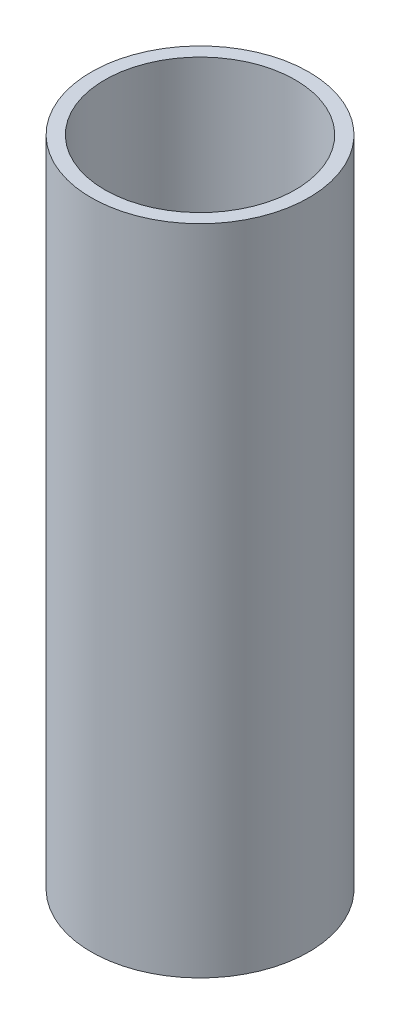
ISO-10303-21;
HEADER;
FILE_DESCRIPTION(('STEP AP214'),'2;1');
FILE_NAME('part.step','',(''),(''),'','','');
FILE_SCHEMA(('AUTOMOTIVE_DESIGN { 1 0 10303 214 1 1 1 1 }'));
ENDSEC;
DATA;
#1=APPLICATION_CONTEXT('core data for automotive mechanical design processes');
#2=APPLICATION_PROTOCOL_DEFINITION('international standard','automotive_design',2000,#1);
#3=PRODUCT_CONTEXT('',#1,'mechanical');
#4=PRODUCT('Part','Part','',(#3));
#5=PRODUCT_RELATED_PRODUCT_CATEGORY('part','',(#4));
#6=PRODUCT_DEFINITION_FORMATION('','',#4);
#7=PRODUCT_DEFINITION_CONTEXT('part definition',#1,'design');
#8=PRODUCT_DEFINITION('design','',#6,#7);
#9=PRODUCT_DEFINITION_SHAPE('','',#8);
#10=(LENGTH_UNIT() NAMED_UNIT(*) SI_UNIT(.MILLI.,.METRE.));
#11=(NAMED_UNIT(*) PLANE_ANGLE_UNIT() SI_UNIT($,.RADIAN.));
#12=(NAMED_UNIT(*) SI_UNIT($,.STERADIAN.) SOLID_ANGLE_UNIT());
#13=UNCERTAINTY_MEASURE_WITH_UNIT(LENGTH_MEASURE(1.E-05),#10,'distance_accuracy_value','');
#14=(GEOMETRIC_REPRESENTATION_CONTEXT(3) GLOBAL_UNCERTAINTY_ASSIGNED_CONTEXT((#13)) GLOBAL_UNIT_ASSIGNED_CONTEXT((#10,
#11,#12)) REPRESENTATION_CONTEXT('',''));
#15=CARTESIAN_POINT('',(0.,0.,0.));
#16=DIRECTION('',(0.,0.,1.));
#17=DIRECTION('',(1.,0.,0.));
#18=AXIS2_PLACEMENT_3D('',#15,#16,#17);
#19=CARTESIAN_POINT('',(0.,76.2,0.));
#20=DIRECTION('',(0.,-1.,0.));
#21=DIRECTION('',(0.,0.,-1.));
#22=AXIS2_PLACEMENT_3D('',#19,#20,#21);
#23=CYLINDRICAL_SURFACE('',#22,12.7);
#24=CARTESIAN_POINT('',(0.,76.2,0.));
#25=DIRECTION('',(0.,1.,0.));
#26=DIRECTION('',(0.,0.,1.));
#27=AXIS2_PLACEMENT_3D('',#24,#25,#26);
#28=CIRCLE('',#27,12.7);
#29=CARTESIAN_POINT('',(0.,76.2,-12.7));
#30=VERTEX_POINT('',#29);
#31=EDGE_CURVE('E10',#30,#30,#28,.T.);
#32=CARTESIAN_POINT('',(0.,0.,0.));
#33=DIRECTION('',(0.,1.,0.));
#34=DIRECTION('',(0.,0.,1.));
#35=AXIS2_PLACEMENT_3D('',#32,#33,#34);
#36=CIRCLE('',#35,12.7);
#37=CARTESIAN_POINT('',(0.,0.,-12.7));
#38=VERTEX_POINT('',#37);
#39=EDGE_CURVE('E32',#38,#38,#36,.T.);
#40=CARTESIAN_POINT('',(0.,76.2,-12.7));
#41=CARTESIAN_POINT('',(0.,75.40625,-12.7));
#42=CARTESIAN_POINT('',(0.,74.6125,-12.7));
#43=CARTESIAN_POINT('',(0.,73.025,-12.7));
#44=CARTESIAN_POINT('',(0.,72.23125,-12.7));
#45=CARTESIAN_POINT('',(0.,70.64375,-12.7));
#46=CARTESIAN_POINT('',(0.,69.85,-12.7));
#47=CARTESIAN_POINT('',(0.,68.2625,-12.7));
#48=CARTESIAN_POINT('',(0.,67.46875,-12.7));
#49=CARTESIAN_POINT('',(0.,65.88125,-12.7));
#50=CARTESIAN_POINT('',(0.,65.0875,-12.7));
#51=CARTESIAN_POINT('',(0.,63.5,-12.7));
#52=CARTESIAN_POINT('',(0.,62.70625,-12.7));
#53=CARTESIAN_POINT('',(0.,61.11875,-12.7));
#54=CARTESIAN_POINT('',(0.,60.325,-12.7));
#55=CARTESIAN_POINT('',(0.,58.7375,-12.7));
#56=CARTESIAN_POINT('',(0.,57.94375,-12.7));
#57=CARTESIAN_POINT('',(0.,56.35625,-12.7));
#58=CARTESIAN_POINT('',(0.,55.5625,-12.7));
#59=CARTESIAN_POINT('',(0.,53.975,-12.7));
#60=CARTESIAN_POINT('',(0.,53.18125,-12.7));
#61=CARTESIAN_POINT('',(0.,51.59375,-12.7));
#62=CARTESIAN_POINT('',(0.,50.8,-12.7));
#63=CARTESIAN_POINT('',(0.,49.2125,-12.7));
#64=CARTESIAN_POINT('',(0.,48.41875,-12.7));
#65=CARTESIAN_POINT('',(0.,46.83125,-12.7));
#66=CARTESIAN_POINT('',(0.,46.0375,-12.7));
#67=CARTESIAN_POINT('',(0.,44.45,-12.7));
#68=CARTESIAN_POINT('',(0.,43.65625,-12.7));
#69=CARTESIAN_POINT('',(0.,42.06875,-12.7));
#70=CARTESIAN_POINT('',(0.,41.275,-12.7));
#71=CARTESIAN_POINT('',(0.,39.6875,-12.7));
#72=CARTESIAN_POINT('',(0.,38.89375,-12.7));
#73=CARTESIAN_POINT('',(0.,37.30625,-12.7));
#74=CARTESIAN_POINT('',(0.,36.5125,-12.7));
#75=CARTESIAN_POINT('',(0.,34.925,-12.7));
#76=CARTESIAN_POINT('',(0.,34.13125,-12.7));
#77=CARTESIAN_POINT('',(0.,32.54375,-12.7));
#78=CARTESIAN_POINT('',(0.,31.75,-12.7));
#79=CARTESIAN_POINT('',(0.,30.1625,-12.7));
#80=CARTESIAN_POINT('',(0.,29.36875,-12.7));
#81=CARTESIAN_POINT('',(0.,27.78125,-12.7));
#82=CARTESIAN_POINT('',(0.,26.9875,-12.7));
#83=CARTESIAN_POINT('',(0.,25.4,-12.7));
#84=CARTESIAN_POINT('',(0.,24.60625,-12.7));
#85=CARTESIAN_POINT('',(0.,23.01875,-12.7));
#86=CARTESIAN_POINT('',(0.,22.225,-12.7));
#87=CARTESIAN_POINT('',(0.,20.6375,-12.7));
#88=CARTESIAN_POINT('',(0.,19.84375,-12.7));
#89=CARTESIAN_POINT('',(0.,18.25625,-12.7));
#90=CARTESIAN_POINT('',(0.,17.4625,-12.7));
#91=CARTESIAN_POINT('',(0.,15.875,-12.7));
#92=CARTESIAN_POINT('',(0.,15.08125,-12.7));
#93=CARTESIAN_POINT('',(0.,13.49375,-12.7));
#94=CARTESIAN_POINT('',(0.,12.7,-12.7));
#95=CARTESIAN_POINT('',(0.,11.1125,-12.7));
#96=CARTESIAN_POINT('',(0.,10.31875,-12.7));
#97=CARTESIAN_POINT('',(0.,8.73125,-12.7));
#98=CARTESIAN_POINT('',(0.,7.93750000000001,-12.7));
#99=CARTESIAN_POINT('',(0.,6.35,-12.7));
#100=CARTESIAN_POINT('',(0.,5.55625,-12.7));
#101=CARTESIAN_POINT('',(0.,3.96875,-12.7));
#102=CARTESIAN_POINT('',(0.,3.175,-12.7));
#103=CARTESIAN_POINT('',(0.,1.5875,-12.7));
#104=CARTESIAN_POINT('',(0.,0.793750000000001,-12.7));
#105=CARTESIAN_POINT('',(0.,0.,-12.7));
#106=B_SPLINE_CURVE_WITH_KNOTS('',3,(#40,#41,#42,#43,#44,#45,#46,#47,#48,#49,#50,#51,#52,#53,
#54,#55,#56,#57,#58,#59,#60,#61,#62,#63,#64,#65,#66,#67,#68,#69,#70,#71,#72,#73,#74,#75,#76,#77,
#78,#79,#80,#81,#82,#83,#84,#85,#86,#87,#88,#89,#90,#91,#92,#93,#94,#95,#96,#97,#98,#99,#100,
#101,#102,#103,#104,#105),.UNSPECIFIED.,.F.,.F.,(4,2,2,2,2,2,2,2,2,2,2,2,2,2,2,2,2,2,2,2,2,2,2,
2,2,2,2,2,2,2,2,2,4),(0.,2.38124999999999,4.76249999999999,7.14374999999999,9.52499999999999,
11.90625,14.2875,16.66875,19.05,21.43125,23.8125,26.19375,28.575,30.95625,33.3375,35.71875,38.1,
40.48125,42.8625,45.24375,47.625,50.00625,52.3875,54.76875,57.15,59.53125,61.9125,64.29375,
66.675,69.05625,71.4375,73.81875,76.2),.UNSPECIFIED.);
#107=EDGE_CURVE('BSEAM29',#30,#38,#106,.T.);
#108=ORIENTED_EDGE('',*,*,#31,.F.);
#109=ORIENTED_EDGE('',*,*,#39,.T.);
#110=ORIENTED_EDGE('',*,*,#107,.T.);
#111=ORIENTED_EDGE('',*,*,#107,.F.);
#112=EDGE_LOOP('',(#108,#110,#109,#111));
#113=FACE_BOUND('',#112,.T.);
#114=ADVANCED_FACE('F29',(#113),#23,.T.);
#115=CARTESIAN_POINT('',(0.,76.2,0.));
#116=DIRECTION('',(0.,1.,0.));
#117=DIRECTION('',(0.,0.,1.));
#118=AXIS2_PLACEMENT_3D('',#115,#116,#117);
#119=PLANE('',#118);
#120=CARTESIAN_POINT('',(0.,76.2,0.));
#121=DIRECTION('',(0.,1.,0.));
#122=DIRECTION('',(0.,0.,1.));
#123=AXIS2_PLACEMENT_3D('',#120,#121,#122);
#124=CIRCLE('',#123,11.1125);
#125=CARTESIAN_POINT('',(0.,76.2,11.1125));
#126=VERTEX_POINT('',#125);
#127=EDGE_CURVE('E41',#126,#126,#124,.T.);
#128=ORIENTED_EDGE('',*,*,#127,.F.);
#129=EDGE_LOOP('',(#128));
#130=FACE_BOUND('',#129,.T.);
#131=ORIENTED_EDGE('',*,*,#31,.T.);
#132=EDGE_LOOP('',(#131));
#133=FACE_BOUND('',#132,.T.);
#134=ADVANCED_FACE('F56',(#130,#133),#119,.T.);
#135=CARTESIAN_POINT('',(0.,0.,0.));
#136=DIRECTION('',(0.,1.,0.));
#137=DIRECTION('',(0.,0.,1.));
#138=AXIS2_PLACEMENT_3D('',#135,#136,#137);
#139=PLANE('',#138);
#140=CARTESIAN_POINT('',(0.,0.,0.));
#141=DIRECTION('',(0.,1.,0.));
#142=DIRECTION('',(0.,0.,1.));
#143=AXIS2_PLACEMENT_3D('',#140,#141,#142);
#144=CIRCLE('',#143,11.1125);
#145=CARTESIAN_POINT('',(0.,0.,11.1125));
#146=VERTEX_POINT('',#145);
#147=EDGE_CURVE('E39',#146,#146,#144,.T.);
#148=ORIENTED_EDGE('',*,*,#147,.T.);
#149=EDGE_LOOP('',(#148));
#150=FACE_BOUND('',#149,.T.);
#151=ORIENTED_EDGE('',*,*,#39,.F.);
#152=EDGE_LOOP('',(#151));
#153=FACE_BOUND('',#152,.T.);
#154=ADVANCED_FACE('F47',(#150,#153),#139,.F.);
#155=CARTESIAN_POINT('',(0.,0.,0.));
#156=DIRECTION('',(0.,1.,0.));
#157=DIRECTION('',(0.,0.,1.));
#158=AXIS2_PLACEMENT_3D('',#155,#156,#157);
#159=CYLINDRICAL_SURFACE('',#158,11.1125);
#160=CARTESIAN_POINT('',(0.,0.,11.1125));
#161=CARTESIAN_POINT('',(0.,0.79375,11.1125));
#162=CARTESIAN_POINT('',(0.,1.5875,11.1125));
#163=CARTESIAN_POINT('',(0.,3.175,11.1125));
#164=CARTESIAN_POINT('',(0.,3.96875,11.1125));
#165=CARTESIAN_POINT('',(0.,5.55625,11.1125));
#166=CARTESIAN_POINT('',(0.,6.35,11.1125));
#167=CARTESIAN_POINT('',(0.,7.9375,11.1125));
#168=CARTESIAN_POINT('',(0.,8.73125,11.1125));
#169=CARTESIAN_POINT('',(0.,10.31875,11.1125));
#170=CARTESIAN_POINT('',(0.,11.1125,11.1125));
#171=CARTESIAN_POINT('',(0.,12.7,11.1125));
#172=CARTESIAN_POINT('',(0.,13.49375,11.1125));
#173=CARTESIAN_POINT('',(0.,15.08125,11.1125));
#174=CARTESIAN_POINT('',(0.,15.875,11.1125));
#175=CARTESIAN_POINT('',(0.,17.4625,11.1125));
#176=CARTESIAN_POINT('',(0.,18.25625,11.1125));
#177=CARTESIAN_POINT('',(0.,19.84375,11.1125));
#178=CARTESIAN_POINT('',(0.,20.6375,11.1125));
#179=CARTESIAN_POINT('',(0.,22.225,11.1125));
#180=CARTESIAN_POINT('',(0.,23.01875,11.1125));
#181=CARTESIAN_POINT('',(0.,24.60625,11.1125));
#182=CARTESIAN_POINT('',(0.,25.4,11.1125));
#183=CARTESIAN_POINT('',(0.,26.9875,11.1125));
#184=CARTESIAN_POINT('',(0.,27.78125,11.1125));
#185=CARTESIAN_POINT('',(0.,29.36875,11.1125));
#186=CARTESIAN_POINT('',(0.,30.1625,11.1125));
#187=CARTESIAN_POINT('',(0.,31.75,11.1125));
#188=CARTESIAN_POINT('',(0.,32.54375,11.1125));
#189=CARTESIAN_POINT('',(0.,34.13125,11.1125));
#190=CARTESIAN_POINT('',(0.,34.925,11.1125));
#191=CARTESIAN_POINT('',(0.,36.5125,11.1125));
#192=CARTESIAN_POINT('',(0.,37.30625,11.1125));
#193=CARTESIAN_POINT('',(0.,38.89375,11.1125));
#194=CARTESIAN_POINT('',(0.,39.6875,11.1125));
#195=CARTESIAN_POINT('',(0.,41.275,11.1125));
#196=CARTESIAN_POINT('',(0.,42.06875,11.1125));
#197=CARTESIAN_POINT('',(0.,43.65625,11.1125));
#198=CARTESIAN_POINT('',(0.,44.45,11.1125));
#199=CARTESIAN_POINT('',(0.,46.0375,11.1125));
#200=CARTESIAN_POINT('',(0.,46.83125,11.1125));
#201=CARTESIAN_POINT('',(0.,48.41875,11.1125));
#202=CARTESIAN_POINT('',(0.,49.2125,11.1125));
#203=CARTESIAN_POINT('',(0.,50.8,11.1125));
#204=CARTESIAN_POINT('',(0.,51.59375,11.1125));
#205=CARTESIAN_POINT('',(0.,53.18125,11.1125));
#206=CARTESIAN_POINT('',(0.,53.975,11.1125));
#207=CARTESIAN_POINT('',(0.,55.5625,11.1125));
#208=CARTESIAN_POINT('',(0.,56.35625,11.1125));
#209=CARTESIAN_POINT('',(0.,57.94375,11.1125));
#210=CARTESIAN_POINT('',(0.,58.7375,11.1125));
#211=CARTESIAN_POINT('',(0.,60.325,11.1125));
#212=CARTESIAN_POINT('',(0.,61.11875,11.1125));
#213=CARTESIAN_POINT('',(0.,62.70625,11.1125));
#214=CARTESIAN_POINT('',(0.,63.5,11.1125));
#215=CARTESIAN_POINT('',(0.,65.0875,11.1125));
#216=CARTESIAN_POINT('',(0.,65.88125,11.1125));
#217=CARTESIAN_POINT('',(0.,67.46875,11.1125));
#218=CARTESIAN_POINT('',(0.,68.2625,11.1125));
#219=CARTESIAN_POINT('',(0.,69.85,11.1125));
#220=CARTESIAN_POINT('',(0.,70.64375,11.1125));
#221=CARTESIAN_POINT('',(0.,72.23125,11.1125));
#222=CARTESIAN_POINT('',(0.,73.025,11.1125));
#223=CARTESIAN_POINT('',(0.,74.6125,11.1125));
#224=CARTESIAN_POINT('',(0.,75.40625,11.1125));
#225=CARTESIAN_POINT('',(0.,76.2,11.1125));
#226=B_SPLINE_CURVE_WITH_KNOTS('',3,(#160,#161,#162,#163,#164,#165,#166,#167,#168,#169,#170,
#171,#172,#173,#174,#175,#176,#177,#178,#179,#180,#181,#182,#183,#184,#185,#186,#187,#188,#189,
#190,#191,#192,#193,#194,#195,#196,#197,#198,#199,#200,#201,#202,#203,#204,#205,#206,#207,#208,
#209,#210,#211,#212,#213,#214,#215,#216,#217,#218,#219,#220,#221,#222,#223,#224,#225),
.UNSPECIFIED.,.F.,.F.,(4,2,2,2,2,2,2,2,2,2,2,2,2,2,2,2,2,2,2,2,2,2,2,2,2,2,2,2,2,2,2,2,4),(0.,
2.38125,4.7625,7.14375,9.525,11.90625,14.2875,16.66875,19.05,21.43125,23.8125,26.19375,28.575,
30.95625,33.3375,35.71875,38.1,40.48125,42.8625,45.24375,47.625,50.00625,52.3875,54.76875,57.15,
59.53125,61.9125,64.29375,66.675,69.05625,71.4375,73.81875,76.2),.UNSPECIFIED.);
#227=EDGE_CURVE('BSEAM50',#146,#126,#226,.T.);
#228=ORIENTED_EDGE('',*,*,#147,.F.);
#229=ORIENTED_EDGE('',*,*,#127,.T.);
#230=ORIENTED_EDGE('',*,*,#227,.T.);
#231=ORIENTED_EDGE('',*,*,#227,.F.);
#232=EDGE_LOOP('',(#228,#230,#229,#231));
#233=FACE_BOUND('',#232,.T.);
#234=ADVANCED_FACE('F50',(#233),#159,.F.);
#235=CLOSED_SHELL('',(#114,#134,#154,#234));
#236=MANIFOLD_SOLID_BREP('B2',#235);
#237=ADVANCED_BREP_SHAPE_REPRESENTATION('',(#18,#236),#14);
#238=SHAPE_DEFINITION_REPRESENTATION(#9,#237);
ENDSEC;
END-ISO-10303-21;
